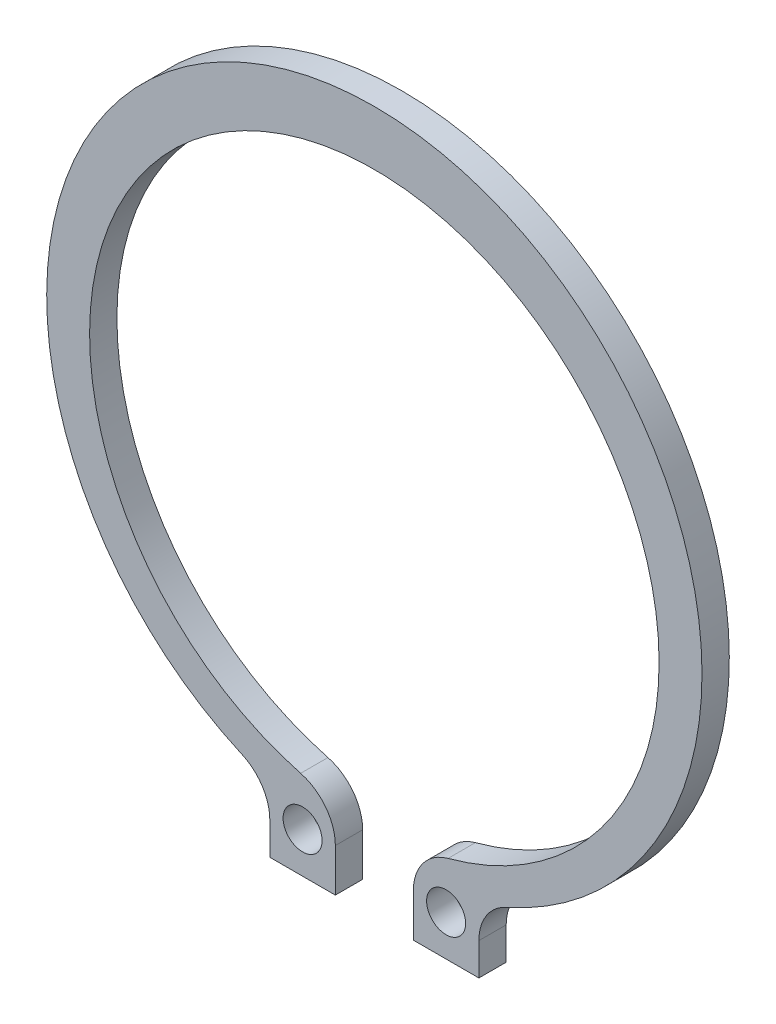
from build123d import *

# Parameters (mm, degrees)
BOSS_EXTRUDE1_DEPTH = 1.75
SKETCH2_R           = 1.25
CUT_EXTRUDE1_DEPTH  = 32.399454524
FILLET1_R           = 3
FILLET2_R           = 3


with BuildPart() as part:
    # Sketch1 → Boss-Extrude1 (new body)
    with BuildSketch(Plane.XY):
        with BuildLine():
            Line((-6.7, -19.152512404), (-6.7, -23.27795619))
            Line((-6.7, -23.27795619), (-2.5, -23.27795619))
            Line((-2.5, -23.27795619), (-2.5, -18.07795619))
            ThreePointArc((-2.5, -18.07795619), (0, 18.25), (2.5, -18.07795619))
            Line((2.5, -18.07795619), (2.5, -23.27795619))
            Line((2.5, -23.27795619), (6.7, -23.27795619))
            Line((6.7, -23.27795619), (6.7, -19.152512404))
            ThreePointArc((6.7, -19.152512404), (0, 21.75), (-6.7, -19.152512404))
        make_face()
    extrude(amount=BOSS_EXTRUDE1_DEPTH)

    # Sketch2 → Cut-Extrude1 (cut, through all)
    with BuildSketch(Plane(origin=(0, 0, 0), x_dir=(-1, 0, 0), z_dir=(0, 0, -1))):
        with Locations((-4.6, -20.67795619)):
            Circle(SKETCH2_R)
    cut_extrude1 = extrude(amount=-CUT_EXTRUDE1_DEPTH, mode=Mode.SUBTRACT)

    # Fillet1
    fillet1_edges = [part.edges().sort_by_distance(p)[0] for p in [
        (6.7, -19.152512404, 0.875),
        (-6.7, -19.152512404, 0.875),
    ]]
    fillet(fillet1_edges, radius=FILLET1_R)

    # Fillet2
    fillet2_edges = [part.edges().sort_by_distance(p)[0] for p in [
        (2.5, -18.07795619, 0.875),
        (-2.5, -18.07795619, 0.875),
    ]]
    fillet(fillet2_edges, radius=FILLET2_R)

    # Mirror1: Cut-Extrude1 across plane
    add(cut_extrude1.mirror(Plane(origin=(0, 0, 0), x_dir=(0, 0, 1), z_dir=(1, 0, 0))), mode=Mode.SUBTRACT)


solid = part.part
